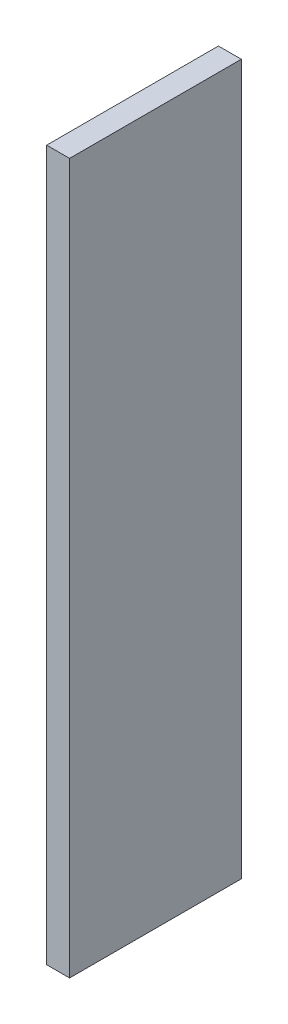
ISO-10303-21;
HEADER;
FILE_DESCRIPTION(('STEP AP214'),'2;1');
FILE_NAME('part.step','',(''),(''),'','','');
FILE_SCHEMA(('AUTOMOTIVE_DESIGN { 1 0 10303 214 1 1 1 1 }'));
ENDSEC;
DATA;
#1=APPLICATION_CONTEXT('core data for automotive mechanical design processes');
#2=APPLICATION_PROTOCOL_DEFINITION('international standard','automotive_design',2000,#1);
#3=PRODUCT_CONTEXT('',#1,'mechanical');
#4=PRODUCT('Part','Part','',(#3));
#5=PRODUCT_RELATED_PRODUCT_CATEGORY('part','',(#4));
#6=PRODUCT_DEFINITION_FORMATION('','',#4);
#7=PRODUCT_DEFINITION_CONTEXT('part definition',#1,'design');
#8=PRODUCT_DEFINITION('design','',#6,#7);
#9=PRODUCT_DEFINITION_SHAPE('','',#8);
#10=(LENGTH_UNIT() NAMED_UNIT(*) SI_UNIT(.MILLI.,.METRE.));
#11=(NAMED_UNIT(*) PLANE_ANGLE_UNIT() SI_UNIT($,.RADIAN.));
#12=(NAMED_UNIT(*) SI_UNIT($,.STERADIAN.) SOLID_ANGLE_UNIT());
#13=UNCERTAINTY_MEASURE_WITH_UNIT(LENGTH_MEASURE(1.E-05),#10,'distance_accuracy_value','');
#14=(GEOMETRIC_REPRESENTATION_CONTEXT(3) GLOBAL_UNCERTAINTY_ASSIGNED_CONTEXT((#13)) GLOBAL_UNIT_ASSIGNED_CONTEXT((#10,
#11,#12)) REPRESENTATION_CONTEXT('',''));
#15=CARTESIAN_POINT('',(0.,0.,0.));
#16=DIRECTION('',(0.,0.,1.));
#17=DIRECTION('',(1.,0.,0.));
#18=AXIS2_PLACEMENT_3D('',#15,#16,#17);
#19=CARTESIAN_POINT('',(3.89999999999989,62.,30.));
#20=DIRECTION('',(0.,0.,-1.));
#21=DIRECTION('',(-1.,0.,0.));
#22=AXIS2_PLACEMENT_3D('',#19,#20,#21);
#23=PLANE('',#22);
#24=DIRECTION('',(-1.,0.,0.));
#25=VECTOR('',#24,1.);
#26=CARTESIAN_POINT('',(3.90000000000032,-62.,30.));
#27=LINE('',#26,#25);
#28=CARTESIAN_POINT('',(4.00000000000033,-62.,30.));
#29=VERTEX_POINT('',#28);
#30=CARTESIAN_POINT('',(3.24826970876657E-13,-62.,30.));
#31=VERTEX_POINT('',#30);
#32=EDGE_CURVE('E10',#29,#31,#27,.T.);
#33=ORIENTED_EDGE('',*,*,#32,.F.);
#34=DIRECTION('',(0.,-1.,0.));
#35=VECTOR('',#34,1.);
#36=CARTESIAN_POINT('',(3.99999999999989,62.,30.));
#37=LINE('',#36,#35);
#38=CARTESIAN_POINT('',(3.99999999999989,62.,30.));
#39=VERTEX_POINT('',#38);
#40=EDGE_CURVE('E78',#39,#29,#37,.T.);
#41=ORIENTED_EDGE('',*,*,#40,.F.);
#42=DIRECTION('',(-1.,0.,0.));
#43=VECTOR('',#42,1.);
#44=CARTESIAN_POINT('',(3.89999999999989,62.,30.));
#45=LINE('',#44,#43);
#46=CARTESIAN_POINT('',(-1.08203376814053E-13,62.,30.));
#47=VERTEX_POINT('',#46);
#48=EDGE_CURVE('E37',#39,#47,#45,.T.);
#49=ORIENTED_EDGE('',*,*,#48,.T.);
#50=DIRECTION('',(0.,-1.,0.));
#51=VECTOR('',#50,1.);
#52=CARTESIAN_POINT('',(-1.08203376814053E-13,62.,30.));
#53=LINE('',#52,#51);
#54=EDGE_CURVE('E80',#31,#47,#53,.F.);
#55=ORIENTED_EDGE('',*,*,#54,.F.);
#56=EDGE_LOOP('',(#33,#41,#49,#55));
#57=FACE_BOUND('',#56,.T.);
#58=ADVANCED_FACE('F16',(#57),#23,.F.);
#59=CARTESIAN_POINT('',(3.90000000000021,-62.,0.));
#60=DIRECTION('',(0.,1.,0.));
#61=DIRECTION('',(-1.,0.,0.));
#62=AXIS2_PLACEMENT_3D('',#59,#60,#61);
#63=PLANE('',#62);
#64=DIRECTION('',(1.,0.,0.));
#65=VECTOR('',#64,1.);
#66=CARTESIAN_POINT('',(3.90000000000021,-62.,0.));
#67=LINE('',#66,#65);
#68=CARTESIAN_POINT('',(2.16189913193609E-13,-62.,0.));
#69=VERTEX_POINT('',#68);
#70=CARTESIAN_POINT('',(4.00000000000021,-62.,0.));
#71=VERTEX_POINT('',#70);
#72=EDGE_CURVE('E85',#69,#71,#67,.T.);
#73=ORIENTED_EDGE('',*,*,#72,.T.);
#74=DIRECTION('',(0.,0.,-1.));
#75=VECTOR('',#74,1.);
#76=CARTESIAN_POINT('',(4.00000000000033,-62.,30.));
#77=LINE('',#76,#75);
#78=EDGE_CURVE('E82',#29,#71,#77,.T.);
#79=ORIENTED_EDGE('',*,*,#78,.F.);
#80=ORIENTED_EDGE('',*,*,#32,.T.);
#81=DIRECTION('',(0.,0.,-1.));
#82=VECTOR('',#81,1.);
#83=CARTESIAN_POINT('',(2.16623594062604E-13,-62.,0.));
#84=LINE('',#83,#82);
#85=EDGE_CURVE('E24',#31,#69,#84,.T.);
#86=ORIENTED_EDGE('',*,*,#85,.T.);
#87=EDGE_LOOP('',(#73,#79,#80,#86));
#88=FACE_BOUND('',#87,.T.);
#89=ADVANCED_FACE('F83',(#88),#63,.F.);
#90=CARTESIAN_POINT('',(-1.08203376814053E-13,62.,30.));
#91=DIRECTION('',(1.,0.,0.));
#92=DIRECTION('',(0.,0.,-1.));
#93=AXIS2_PLACEMENT_3D('',#90,#91,#92);
#94=PLANE('',#93);
#95=ORIENTED_EDGE('',*,*,#85,.F.);
#96=ORIENTED_EDGE('',*,*,#54,.T.);
#97=DIRECTION('',(0.,0.,-1.));
#98=VECTOR('',#97,1.);
#99=CARTESIAN_POINT('',(-2.16406753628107E-13,62.,0.));
#100=LINE('',#99,#98);
#101=CARTESIAN_POINT('',(-2.16840434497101E-13,62.,0.));
#102=VERTEX_POINT('',#101);
#103=EDGE_CURVE('E135',#47,#102,#100,.T.);
#104=ORIENTED_EDGE('',*,*,#103,.T.);
#105=DIRECTION('',(0.,1.,0.));
#106=VECTOR('',#105,1.);
#107=CARTESIAN_POINT('',(2.17057274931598E-13,-62.2828427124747,0.));
#108=LINE('',#107,#106);
#109=CARTESIAN_POINT('',(-1.67834496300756E-13,48.,0.));
#110=VERTEX_POINT('',#109);
#111=EDGE_CURVE('E99',#110,#102,#108,.T.);
#112=ORIENTED_EDGE('',*,*,#111,.F.);
#113=DIRECTION('',(0.,0.,-1.));
#114=VECTOR('',#113,1.);
#115=CARTESIAN_POINT('',(0.,48.,30.));
#116=LINE('',#115,#114);
#117=CARTESIAN_POINT('',(-1.46367293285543E-13,48.,6.));
#118=VERTEX_POINT('',#117);
#119=EDGE_CURVE('E104',#118,#110,#116,.T.);
#120=ORIENTED_EDGE('',*,*,#119,.F.);
#121=DIRECTION('',(0.,1.,0.));
#122=VECTOR('',#121,1.);
#123=CARTESIAN_POINT('',(-1.94722710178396E-13,62.,6.));
#124=LINE('',#123,#122);
#125=CARTESIAN_POINT('',(1.89084858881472E-13,-48.,6.));
#126=VERTEX_POINT('',#125);
#127=EDGE_CURVE('E106',#126,#118,#124,.T.);
#128=ORIENTED_EDGE('',*,*,#127,.F.);
#129=DIRECTION('',(0.,0.,-1.));
#130=VECTOR('',#129,1.);
#131=CARTESIAN_POINT('',(2.75821032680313E-13,-48.,30.));
#132=LINE('',#131,#130);
#133=CARTESIAN_POINT('',(1.67183974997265E-13,-48.,0.));
#134=VERTEX_POINT('',#133);
#135=EDGE_CURVE('E109',#134,#126,#132,.F.);
#136=ORIENTED_EDGE('',*,*,#135,.F.);
#137=EDGE_CURVE('E100',#69,#134,#108,.T.);
#138=ORIENTED_EDGE('',*,*,#137,.F.);
#139=EDGE_LOOP('',(#95,#96,#104,#112,#120,#128,#136,#138));
#140=FACE_BOUND('',#139,.T.);
#141=ADVANCED_FACE('F18',(#140),#94,.F.);
#142=CARTESIAN_POINT('',(3.89999999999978,62.,0.));
#143=DIRECTION('',(0.,1.,0.));
#144=DIRECTION('',(-1.,0.,0.));
#145=AXIS2_PLACEMENT_3D('',#142,#143,#144);
#146=PLANE('',#145);
#147=ORIENTED_EDGE('',*,*,#48,.F.);
#148=DIRECTION('',(0.,0.,1.));
#149=VECTOR('',#148,1.);
#150=CARTESIAN_POINT('',(3.99999999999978,62.,0.));
#151=LINE('',#150,#149);
#152=CARTESIAN_POINT('',(3.99999999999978,62.,0.));
#153=VERTEX_POINT('',#152);
#154=EDGE_CURVE('E94',#153,#39,#151,.T.);
#155=ORIENTED_EDGE('',*,*,#154,.F.);
#156=DIRECTION('',(1.,0.,0.));
#157=VECTOR('',#156,1.);
#158=CARTESIAN_POINT('',(3.89999999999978,62.,0.));
#159=LINE('',#158,#157);
#160=EDGE_CURVE('E133',#102,#153,#159,.T.);
#161=ORIENTED_EDGE('',*,*,#160,.F.);
#162=ORIENTED_EDGE('',*,*,#103,.F.);
#163=EDGE_LOOP('',(#147,#155,#161,#162));
#164=FACE_BOUND('',#163,.T.);
#165=ADVANCED_FACE('F161',(#164),#146,.T.);
#166=CARTESIAN_POINT('',(-6.,0.,15.));
#167=DIRECTION('',(-1.,0.,0.));
#168=DIRECTION('',(0.,0.,1.));
#169=AXIS2_PLACEMENT_3D('',#166,#167,#168);
#170=PLANE('',#169);
#171=DIRECTION('',(0.,0.,1.));
#172=VECTOR('',#171,1.);
#173=CARTESIAN_POINT('',(-5.99999999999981,-48.,6.));
#174=LINE('',#173,#172);
#175=CARTESIAN_POINT('',(-5.99999999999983,-48.,0.));
#176=VERTEX_POINT('',#175);
#177=CARTESIAN_POINT('',(-5.99999999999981,-48.,6.));
#178=VERTEX_POINT('',#177);
#179=EDGE_CURVE('E126',#176,#178,#174,.T.);
#180=ORIENTED_EDGE('',*,*,#179,.T.);
#181=DIRECTION('',(0.,1.,0.));
#182=VECTOR('',#181,1.);
#183=CARTESIAN_POINT('',(-6.00000000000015,48.,6.));
#184=LINE('',#183,#182);
#185=CARTESIAN_POINT('',(-6.00000000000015,48.,6.));
#186=VERTEX_POINT('',#185);
#187=EDGE_CURVE('E121',#178,#186,#184,.T.);
#188=ORIENTED_EDGE('',*,*,#187,.T.);
#189=DIRECTION('',(0.,0.,-1.));
#190=VECTOR('',#189,1.);
#191=CARTESIAN_POINT('',(-6.00000000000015,48.,6.));
#192=LINE('',#191,#190);
#193=CARTESIAN_POINT('',(-6.00000000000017,48.,0.));
#194=VERTEX_POINT('',#193);
#195=EDGE_CURVE('E115',#186,#194,#192,.T.);
#196=ORIENTED_EDGE('',*,*,#195,.T.);
#197=DIRECTION('',(0.,1.,0.));
#198=VECTOR('',#197,1.);
#199=CARTESIAN_POINT('',(-6.00000000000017,48.,0.));
#200=LINE('',#199,#198);
#201=EDGE_CURVE('E103',#194,#176,#200,.F.);
#202=ORIENTED_EDGE('',*,*,#201,.T.);
#203=EDGE_LOOP('',(#180,#188,#196,#202));
#204=FACE_BOUND('',#203,.T.);
#205=ADVANCED_FACE('F155',(#204),#170,.T.);
#206=CARTESIAN_POINT('',(-6.00000000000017,48.,0.));
#207=DIRECTION('',(0.,0.,1.));
#208=DIRECTION('',(1.,0.,0.));
#209=AXIS2_PLACEMENT_3D('',#206,#207,#208);
#210=PLANE('',#209);
#211=DIRECTION('',(-1.,0.,0.));
#212=VECTOR('',#211,1.);
#213=CARTESIAN_POINT('',(-5.99999999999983,-48.,0.));
#214=LINE('',#213,#212);
#215=EDGE_CURVE('E128',#134,#176,#214,.T.);
#216=ORIENTED_EDGE('',*,*,#215,.T.);
#217=ORIENTED_EDGE('',*,*,#201,.F.);
#218=DIRECTION('',(1.,0.,0.));
#219=VECTOR('',#218,1.);
#220=CARTESIAN_POINT('',(-6.00000000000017,48.,0.));
#221=LINE('',#220,#219);
#222=EDGE_CURVE('E112',#194,#110,#221,.T.);
#223=ORIENTED_EDGE('',*,*,#222,.T.);
#224=ORIENTED_EDGE('',*,*,#111,.T.);
#225=ORIENTED_EDGE('',*,*,#160,.T.);
#226=DIRECTION('',(0.,1.,0.));
#227=VECTOR('',#226,1.);
#228=CARTESIAN_POINT('',(4.00000000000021,-62.,0.));
#229=LINE('',#228,#227);
#230=EDGE_CURVE('E89',#71,#153,#229,.T.);
#231=ORIENTED_EDGE('',*,*,#230,.F.);
#232=ORIENTED_EDGE('',*,*,#72,.F.);
#233=ORIENTED_EDGE('',*,*,#137,.T.);
#234=EDGE_LOOP('',(#216,#217,#223,#224,#225,#231,#232,#233));
#235=FACE_BOUND('',#234,.T.);
#236=ADVANCED_FACE('F141',(#235),#210,.F.);
#237=CARTESIAN_POINT('',(-5.99999999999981,-48.,6.));
#238=DIRECTION('',(0.,1.,0.));
#239=DIRECTION('',(-1.,0.,0.));
#240=AXIS2_PLACEMENT_3D('',#237,#238,#239);
#241=PLANE('',#240);
#242=ORIENTED_EDGE('',*,*,#135,.T.);
#243=DIRECTION('',(-1.,0.,0.));
#244=VECTOR('',#243,1.);
#245=CARTESIAN_POINT('',(-5.99999999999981,-48.,6.));
#246=LINE('',#245,#244);
#247=EDGE_CURVE('E123',#126,#178,#246,.T.);
#248=ORIENTED_EDGE('',*,*,#247,.T.);
#249=ORIENTED_EDGE('',*,*,#179,.F.);
#250=ORIENTED_EDGE('',*,*,#215,.F.);
#251=EDGE_LOOP('',(#242,#248,#249,#250));
#252=FACE_BOUND('',#251,.T.);
#253=ADVANCED_FACE('F146',(#252),#241,.F.);
#254=CARTESIAN_POINT('',(-6.00000000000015,48.,6.));
#255=DIRECTION('',(0.,0.,-1.));
#256=DIRECTION('',(-1.,0.,0.));
#257=AXIS2_PLACEMENT_3D('',#254,#255,#256);
#258=PLANE('',#257);
#259=DIRECTION('',(1.,0.,0.));
#260=VECTOR('',#259,1.);
#261=CARTESIAN_POINT('',(-6.00000000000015,48.,6.));
#262=LINE('',#261,#260);
#263=EDGE_CURVE('E118',#118,#186,#262,.F.);
#264=ORIENTED_EDGE('',*,*,#263,.T.);
#265=ORIENTED_EDGE('',*,*,#187,.F.);
#266=ORIENTED_EDGE('',*,*,#247,.F.);
#267=ORIENTED_EDGE('',*,*,#127,.T.);
#268=EDGE_LOOP('',(#264,#265,#266,#267));
#269=FACE_BOUND('',#268,.T.);
#270=ADVANCED_FACE('F158',(#269),#258,.F.);
#271=CARTESIAN_POINT('',(-6.00000000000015,48.,6.));
#272=DIRECTION('',(0.,-1.,0.));
#273=DIRECTION('',(0.,0.,-1.));
#274=AXIS2_PLACEMENT_3D('',#271,#272,#273);
#275=PLANE('',#274);
#276=ORIENTED_EDGE('',*,*,#119,.T.);
#277=ORIENTED_EDGE('',*,*,#222,.F.);
#278=ORIENTED_EDGE('',*,*,#195,.F.);
#279=ORIENTED_EDGE('',*,*,#263,.F.);
#280=EDGE_LOOP('',(#276,#277,#278,#279));
#281=FACE_BOUND('',#280,.T.);
#282=ADVANCED_FACE('F153',(#281),#275,.F.);
#283=CARTESIAN_POINT('',(4.,0.,0.));
#284=DIRECTION('',(1.,0.,0.));
#285=DIRECTION('',(0.,0.,-1.));
#286=AXIS2_PLACEMENT_3D('',#283,#284,#285);
#287=PLANE('',#286);
#288=ORIENTED_EDGE('',*,*,#40,.T.);
#289=ORIENTED_EDGE('',*,*,#78,.T.);
#290=ORIENTED_EDGE('',*,*,#230,.T.);
#291=ORIENTED_EDGE('',*,*,#154,.T.);
#292=EDGE_LOOP('',(#288,#289,#290,#291));
#293=FACE_BOUND('',#292,.T.);
#294=ADVANCED_FACE('F92',(#293),#287,.T.);
#295=CLOSED_SHELL('',(#58,#89,#141,#165,#205,#236,#253,#270,#282,#294));
#296=MANIFOLD_SOLID_BREP('B1',#295);
#297=ADVANCED_BREP_SHAPE_REPRESENTATION('',(#18,#296),#14);
#298=SHAPE_DEFINITION_REPRESENTATION(#9,#297);
ENDSEC;
END-ISO-10303-21;
